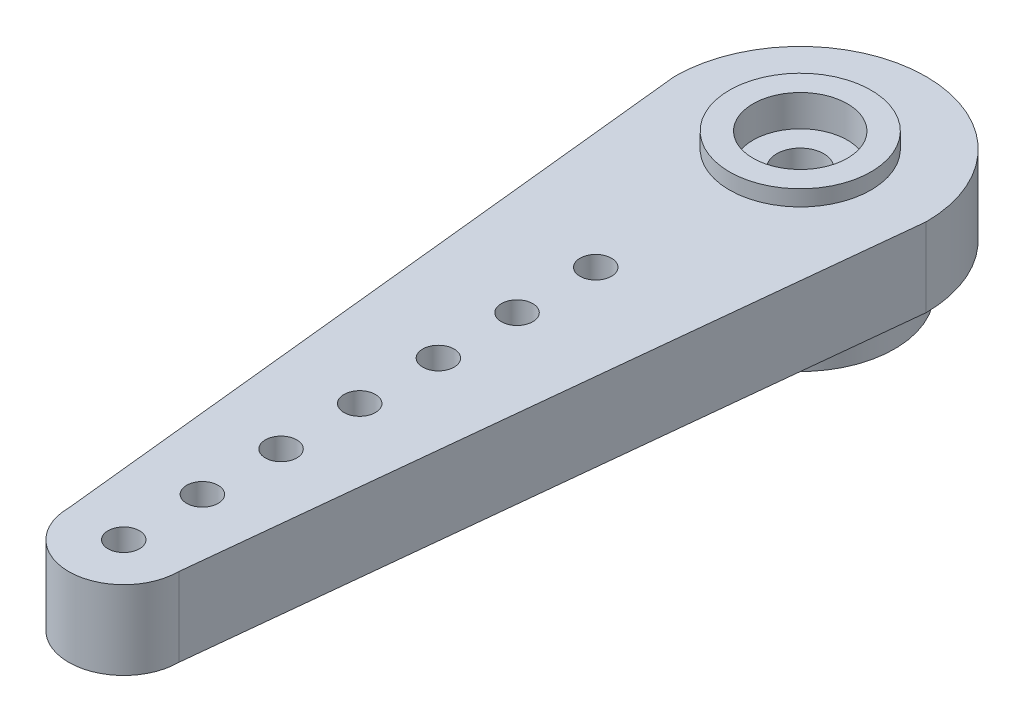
from build123d import *

# Parameters (mm, degrees)
SKETCH1_R           = 6
BOSS_EXTRUDE1_DEPTH = 3
CUT_EXTRUDE4_DEPTH  = 10
BOSS_EXTRUDE2_DEPTH = 5
SKETCH3_R           = 4.5
BOSS_EXTRUDE3_DEPTH = 1
SKETCH4_R           = 3
CUT_EXTRUDE1_DEPTH  = 2
SKETCH5_R           = 1.5
CUT_EXTRUDE2_DEPTH  = 48.699580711
SKETCH6_R           = 1
CUT_EXTRUDE3_DEPTH  = 10
SKETCH8_R           = 1.5
CUT_EXTRUDE5_DEPTH  = 2


with BuildPart() as part:
    # Sketch1 → Boss-Extrude1 (new body)
    with BuildSketch(Plane(origin=(0, 0, 0), x_dir=(1, 0, 0), z_dir=(0, 1, 0))):
        with Locations(Location((0, 0, 0), (0, 0, 270))):
            Circle(SKETCH1_R)
    extrude(amount=BOSS_EXTRUDE1_DEPTH)

    # Sketch7 → Cut-Extrude4 (cut, through all)
    with BuildSketch(Plane.XZ):
        with BuildLine():
            Line((0.7, 3.684087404), (0, 3.05))
            Line((0, 3.05), (-0.7, 3.684087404))
            ThreePointArc((-0.7, 3.684087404), (-0.779668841, 3.668053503), (-0.858971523, 3.650296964))
            Line((-0.858971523, 3.650296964), (-1.240546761, 2.786313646))
            Line((-1.240546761, 2.786313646), (-2.137935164, 3.080865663))
            ThreePointArc((-2.137935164, 3.080865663), (-2.204194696, 3.033813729), (-2.269419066, 2.985337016))
            Line((-2.269419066, 2.985337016), (-2.266591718, 2.040848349))
            Line((-2.266591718, 2.040848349), (-3.206201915, 1.944934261))
            ThreePointArc((-3.206201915, 1.944934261), (-3.247595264, 1.875), (-3.287463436, 1.804185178))
            Line((-3.287463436, 1.804185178), (-2.900722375, 0.942501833))
            Line((-2.900722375, 0.942501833), (-3.720087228, 0.472706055))
            ThreePointArc((-3.720087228, 0.472706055), (-3.729457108, 0.391981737), (-3.737075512, 0.311073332))
            Line((-3.737075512, 0.311073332), (-3.033291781, -0.318811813))
            Line((-3.033291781, -0.318811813), (-3.590735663, -1.081257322))
            ThreePointArc((-3.590735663, -1.081257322), (-3.566461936, -1.158813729), (-3.540513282, -1.235825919))
            Line((-3.540513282, -1.235825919), (-2.641377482, -1.525))
            Line((-2.641377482, -1.525), (-2.840513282, -2.448261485))
            ThreePointArc((-2.840513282, -2.448261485), (-2.786793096, -2.509239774), (-2.73176414, -2.569039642))
            Line((-2.73176414, -2.569039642), (-1.792745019, -2.467501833))
            Line((-1.792745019, -2.467501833), (-1.599140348, -3.391938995))
            ThreePointArc((-1.599140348, -3.391938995), (-1.525262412, -3.425795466), (-1.450668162, -3.458043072))
            Line((-1.450668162, -3.458043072), (-0.634130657, -2.983350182))
            Line((-0.634130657, -2.983350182), (-0.081261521, -3.749119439))
            ThreePointArc((-0.081261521, -3.749119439), (0, -3.75), (0.081261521, -3.749119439))
            Line((0.081261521, -3.749119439), (0.634130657, -2.983350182))
            Line((0.634130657, -2.983350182), (1.450668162, -3.458043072))
            ThreePointArc((1.450668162, -3.458043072), (1.525262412, -3.425795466), (1.599140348, -3.391938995))
            Line((1.599140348, -3.391938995), (1.792745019, -2.467501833))
            Line((1.792745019, -2.467501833), (2.73176414, -2.569039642))
            ThreePointArc((2.73176414, -2.569039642), (2.786793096, -2.509239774), (2.840513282, -2.448261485))
            Line((2.840513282, -2.448261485), (2.641377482, -1.525))
            Line((2.641377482, -1.525), (3.540513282, -1.235825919))
            ThreePointArc((3.540513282, -1.235825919), (3.566461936, -1.158813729), (3.590735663, -1.081257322))
            Line((3.590735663, -1.081257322), (3.033291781, -0.318811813))
            Line((3.033291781, -0.318811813), (3.737075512, 0.311073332))
            ThreePointArc((3.737075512, 0.311073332), (3.729457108, 0.391981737), (3.720087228, 0.472706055))
            Line((3.720087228, 0.472706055), (2.900722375, 0.942501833))
            Line((2.900722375, 0.942501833), (3.287463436, 1.804185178))
            ThreePointArc((3.287463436, 1.804185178), (3.247595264, 1.875), (3.206201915, 1.944934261))
            Line((3.206201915, 1.944934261), (2.266591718, 2.040848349))
            Line((2.266591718, 2.040848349), (2.269419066, 2.985337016))
            ThreePointArc((2.269419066, 2.985337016), (2.204194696, 3.033813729), (2.137935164, 3.080865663))
            Line((2.137935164, 3.080865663), (1.240546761, 2.786313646))
            Line((1.240546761, 2.786313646), (0.858971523, 3.650296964))
            ThreePointArc((0.858971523, 3.650296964), (0.779668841, 3.668053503), (0.7, 3.684087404))
        make_face()
    extrude(amount=-CUT_EXTRUDE4_DEPTH, mode=Mode.SUBTRACT)

    # Sketch2 → Boss-Extrude2 (add)
    with BuildSketch(Plane(origin=(0, 3, 0), x_dir=(1, 0, 0), z_dir=(0, 1, 0))):
        with BuildLine():
            Line((8, 0), (3.5, -43))
            ThreePointArc((3.5, -43), (0, -46.5), (-3.5, -43))
            Line((-3.5, -43), (-8, 0))
            ThreePointArc((-8, 0), (0, 8), (8, 0))
        make_face()
    extrude(amount=BOSS_EXTRUDE2_DEPTH)

    # Sketch3 → Boss-Extrude3 (add)
    with BuildSketch(Plane(origin=(0, 8, 0), x_dir=(1, 0, 0), z_dir=(0, 1, 0))):
        with Locations(Location((0, 0, 0), (0, 0, 270))):
            Circle(SKETCH3_R)
    extrude(amount=BOSS_EXTRUDE3_DEPTH)

    # Sketch4 → Cut-Extrude1 (cut)
    with BuildSketch(Plane(origin=(0, 9, 0), x_dir=(1, 0, 0), z_dir=(0, 1, 0))):
        with Locations(Location((0, 0, 0), (0, 0, 270))):
            Circle(SKETCH4_R)
    extrude(amount=-CUT_EXTRUDE1_DEPTH, mode=Mode.SUBTRACT)

    # Sketch5 → Cut-Extrude2 (cut, through all)
    with BuildSketch(Plane(origin=(0, 7, 0), x_dir=(1, 0, 0), z_dir=(0, 1, 0))):
        with Locations(Location((0, 0, 0), (0, 0, 270))):
            Circle(SKETCH5_R)
    extrude(amount=-CUT_EXTRUDE2_DEPTH, mode=Mode.SUBTRACT)

    # Sketch6 → Cut-Extrude3 (cut)
    with BuildSketch(Plane(origin=(0, 8, 0), x_dir=(1, 0, 0), z_dir=(0, 1, 0))):
        with Locations(Location((0, -13, 0), (0, 0, 270))):
            Circle(SKETCH6_R)
        with Locations(Location((0, -18, 0), (0, 0, 270))):
            Circle(SKETCH6_R)
        with Locations(Location((0, -23, 0), (0, 0, 270))):
            Circle(SKETCH6_R)
        with Locations(Location((0, -28, 0), (0, 0, 270))):
            Circle(SKETCH6_R)
        with Locations(Location((0, -33, 0), (0, 0, 270))):
            Circle(SKETCH6_R)
        with Locations(Location((0, -38, 0), (0, 0, 270))):
            Circle(SKETCH6_R)
        with Locations(Location((0, -43, 0), (0, 0, 270))):
            Circle(SKETCH6_R)
    extrude(amount=-CUT_EXTRUDE3_DEPTH, mode=Mode.SUBTRACT)

    # Sketch8 → Cut-Extrude5 (cut)
    with BuildSketch(Plane.XZ.offset(-3)):
        with BuildLine():
            Line((-0.858971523, 3.650296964), (-1.240546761, 2.786313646))
            Line((-1.240546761, 2.786313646), (-2.137935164, 3.080865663))
            ThreePointArc((-2.137935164, 3.080865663), (-2.204194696, 3.033813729), (-2.269419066, 2.985337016))
            Line((-2.269419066, 2.985337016), (-2.266591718, 2.040848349))
            Line((-2.266591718, 2.040848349), (-3.206201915, 1.944934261))
            ThreePointArc((-3.206201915, 1.944934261), (-3.247595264, 1.875), (-3.287463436, 1.804185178))
            Line((-3.287463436, 1.804185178), (-2.900722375, 0.942501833))
            Line((-2.900722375, 0.942501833), (-3.720087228, 0.472706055))
            ThreePointArc((-3.720087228, 0.472706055), (-3.729457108, 0.391981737), (-3.737075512, 0.311073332))
            Line((-3.737075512, 0.311073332), (-3.033291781, -0.318811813))
            Line((-3.033291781, -0.318811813), (-3.590735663, -1.081257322))
            ThreePointArc((-3.590735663, -1.081257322), (-3.566461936, -1.158813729), (-3.540513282, -1.235825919))
            Line((-3.540513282, -1.235825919), (-2.641377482, -1.525))
            Line((-2.641377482, -1.525), (-2.840513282, -2.448261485))
            ThreePointArc((-2.840513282, -2.448261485), (-2.786793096, -2.509239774), (-2.73176414, -2.569039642))
            Line((-2.73176414, -2.569039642), (-1.792745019, -2.467501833))
            Line((-1.792745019, -2.467501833), (-1.599140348, -3.391938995))
            ThreePointArc((-1.599140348, -3.391938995), (-1.525262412, -3.425795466), (-1.450668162, -3.458043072))
            Line((-1.450668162, -3.458043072), (-0.634130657, -2.983350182))
            Line((-0.634130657, -2.983350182), (-0.081261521, -3.749119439))
            ThreePointArc((-0.081261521, -3.749119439), (0, -3.75), (0.081261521, -3.749119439))
            Line((0.081261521, -3.749119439), (0.634130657, -2.983350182))
            Line((0.634130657, -2.983350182), (1.450668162, -3.458043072))
            ThreePointArc((1.450668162, -3.458043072), (1.525262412, -3.425795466), (1.599140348, -3.391938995))
            Line((1.599140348, -3.391938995), (1.792745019, -2.467501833))
            Line((1.792745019, -2.467501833), (2.73176414, -2.569039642))
            ThreePointArc((2.73176414, -2.569039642), (2.786793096, -2.509239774), (2.840513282, -2.448261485))
            Line((2.840513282, -2.448261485), (2.641377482, -1.525))
            Line((2.641377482, -1.525), (3.540513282, -1.235825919))
            ThreePointArc((3.540513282, -1.235825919), (3.566461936, -1.158813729), (3.590735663, -1.081257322))
            Line((3.590735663, -1.081257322), (3.033291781, -0.318811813))
            Line((3.033291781, -0.318811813), (3.737075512, 0.311073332))
            ThreePointArc((3.737075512, 0.311073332), (3.729457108, 0.391981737), (3.720087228, 0.472706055))
            Line((3.720087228, 0.472706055), (2.900722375, 0.942501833))
            Line((2.900722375, 0.942501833), (3.287463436, 1.804185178))
            ThreePointArc((3.287463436, 1.804185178), (3.247595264, 1.875), (3.206201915, 1.944934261))
            Line((3.206201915, 1.944934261), (2.266591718, 2.040848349))
            Line((2.266591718, 2.040848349), (2.269419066, 2.985337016))
            ThreePointArc((2.269419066, 2.985337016), (2.204194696, 3.033813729), (2.137935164, 3.080865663))
            Line((2.137935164, 3.080865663), (1.240546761, 2.786313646))
            Line((1.240546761, 2.786313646), (0.858971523, 3.650296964))
            ThreePointArc((0.858971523, 3.650296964), (0.779668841, 3.668053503), (0.7, 3.684087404))
            Line((0.7, 3.684087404), (0, 3.05))
            Line((0, 3.05), (-0.7, 3.684087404))
            ThreePointArc((-0.7, 3.684087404), (-0.779668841, 3.668053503), (-0.858971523, 3.650296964))
        make_face()
        with Locations(Location((0, 0, 0), (0, 0, 90))):
            Circle(SKETCH8_R, mode=Mode.SUBTRACT)
    extrude(amount=-CUT_EXTRUDE5_DEPTH, mode=Mode.SUBTRACT)


solid = part.part
